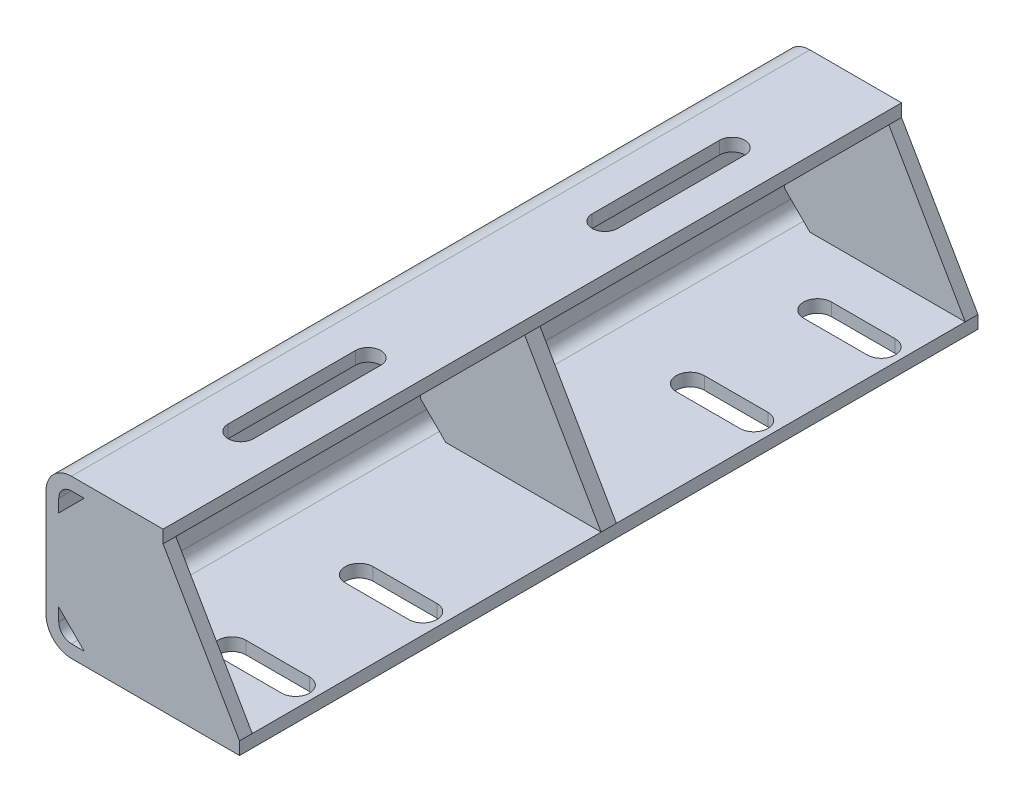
from build123d import *

# Parameters (mm, degrees)
BOSS_EXTRU_2_DEPTH                = 290
BOSS_EXTRU_3_DEPTH                = 5
R_P_TITION_LIN_AIRE1_COUNT        = 2
R_P_TITION_LIN_AIRE1_PITCH        = 143
R_P_TITION_LIN_AIRE2_COUNT        = 2
R_P_TITION_LIN_AIRE2_PITCH        = 142
R_P_TITION_LIN_AIRE2_COPY_1_DEPTH = 5
ENL_V_MAT_EXTRU_1_DEPTH           = 10
ENL_V_MAT_EXTRU_2_DEPTH           = 10


with BuildPart() as part:
    # Esquisse1 → Boss.-Extru.2 (new body)
    with BuildSketch(Plane.XY):
        with BuildLine():
            Line((71, 5), (76, 5))
            Line((76, 5), (76, 0))
            Line((76, 0), (10, 0))
            ThreePointArc((10, 0), (2.928932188, 2.928932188), (0, 10))
            Line((0, 10), (0, 52))
            ThreePointArc((0, 52), (2.928932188, 59.071067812), (10, 62))
            Line((10, 62), (45.977786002, 62))
            Line((45.977786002, 62), (45.977786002, 57))
            Line((45.977786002, 57), (10, 57))
            ThreePointArc((10, 57), (6.464466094, 55.535533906), (5, 52))
            Line((5, 52), (5, 10))
            ThreePointArc((5, 10), (6.464466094, 6.464466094), (10, 5))
            Line((10, 5), (71, 5))
        make_face()
    extrude(amount=BOSS_EXTRU_2_DEPTH)

    # Esquisse2 → Boss.-Extru.3 (add)
    with BuildSketch(Plane.XY.offset(290)):
        Polygon((15, 57), (45.977786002, 57), (76, 5), (15, 5), (5, 15), (5, 47), align=None)
    boss_extru_3 = extrude(amount=-BOSS_EXTRU_3_DEPTH)

    # R_p_tition lin_aire1: Boss.-Extru.3 ×2
    with Locations(*[(0, 0, -i * R_P_TITION_LIN_AIRE1_PITCH) for i in range(1, R_P_TITION_LIN_AIRE1_COUNT)]):
        add(boss_extru_3)

    # R_p_tition lin_aire2: Boss.-Extru.3 ×2
    with Locations(*[(0, 0, -i * R_P_TITION_LIN_AIRE2_PITCH) for i in range(1, R_P_TITION_LIN_AIRE2_COUNT)]):
        add(boss_extru_3)

    # R_p_tition lin_aire2 copy 1 sketch → R_p_tition lin_aire2 copy 1 (add)
    with BuildSketch(Plane.XY.offset(5)):
        Polygon((15, 57), (45.977786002, 57), (76, 5), (15, 5), (5, 15), (5, 47), align=None)
    extrude(amount=-R_P_TITION_LIN_AIRE2_COPY_1_DEPTH)

    # Esquisse3 → Enl_v. mat.-Extru.1 (cut)
    with BuildSketch(Plane(origin=(0, 62, 0), x_dir=(1, 0, 0), z_dir=(0, 1, 0))):
        with BuildLine():
            Line((32.988893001, -48.5), (32.988893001, -98.5))
            ThreePointArc((32.988893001, -98.5), (27.988893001, -103.5), (22.988893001, -98.5))
            Line((22.988893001, -98.5), (22.988893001, -48.5))
            ThreePointArc((22.988893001, -48.5), (27.988893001, -43.5), (32.988893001, -48.5))
        make_face()
        with BuildLine():
            Line((32.988893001, -191.5), (32.988893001, -241.5))
            ThreePointArc((32.988893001, -241.5), (27.988893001, -246.5), (22.988893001, -241.5))
            Line((22.988893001, -241.5), (22.988893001, -191.5))
            ThreePointArc((22.988893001, -191.5), (27.988893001, -186.5), (32.988893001, -191.5))
        make_face()
    extrude(amount=-ENL_V_MAT_EXTRU_1_DEPTH, mode=Mode.SUBTRACT)

    # Esquisse4 → Enl_v. mat.-Extru.2 (cut)
    with BuildSketch(Plane.XZ):
        with BuildLine():
            Line((43, 265.5), (68, 265.5))
            ThreePointArc((68, 265.5), (73.5, 260), (68, 254.5))
            Line((68, 254.5), (43, 254.5))
            ThreePointArc((43, 254.5), (37.5, 260), (43, 265.5))
        make_face()
        with BuildLine():
            Line((43, 85.5), (68, 85.5))
            ThreePointArc((68, 85.5), (73.5, 80), (68, 74.5))
            Line((68, 74.5), (43, 74.5))
            ThreePointArc((43, 74.5), (37.5, 80), (43, 85.5))
        make_face()
        with BuildLine():
            Line((43, 35.5), (68, 35.5))
            ThreePointArc((68, 35.5), (73.5, 30), (68, 24.5))
            Line((68, 24.5), (43, 24.5))
            ThreePointArc((43, 24.5), (37.5, 30), (43, 35.5))
        make_face()
        with BuildLine():
            Line((43, 215.5), (68, 215.5))
            ThreePointArc((68, 215.5), (73.5, 210), (68, 204.5))
            Line((68, 204.5), (43, 204.5))
            ThreePointArc((43, 204.5), (37.5, 210), (43, 215.5))
        make_face()
    extrude(amount=-ENL_V_MAT_EXTRU_2_DEPTH, mode=Mode.SUBTRACT)


solid = part.part
